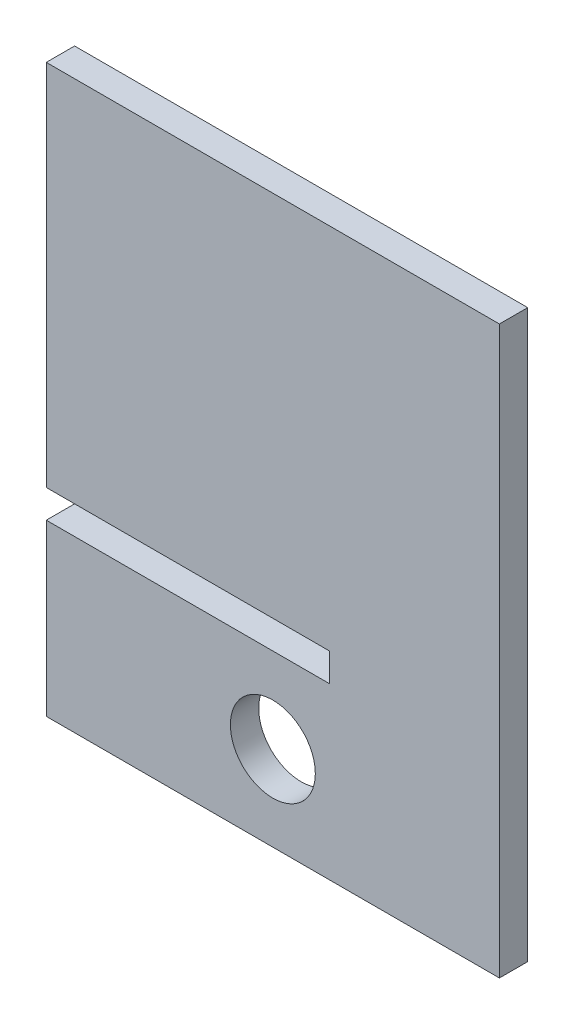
from build123d import *

# Parameters (mm, degrees)
ESQUISSE1_R        = 7.5
BOSS_EXTRU_1_DEPTH = 5


with BuildPart() as part:
    # Esquisse1 → Boss.-Extru.1 (new body)
    with BuildSketch(Plane.XY):
        Polygon((-41.557253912, -39.116246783), (-41.557253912, -69.116246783), (38.442746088, -69.116246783), (38.442746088, 30.883753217), (-41.557253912, 30.883753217), (-41.557253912, -34.116246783), (8.442746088, -34.116246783), (8.442746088, -39.116246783), align=None)
        with Locations((-1.557253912, -54.116246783)):
            Circle(ESQUISSE1_R, mode=Mode.SUBTRACT)
    extrude(amount=BOSS_EXTRU_1_DEPTH)


solid = part.part
